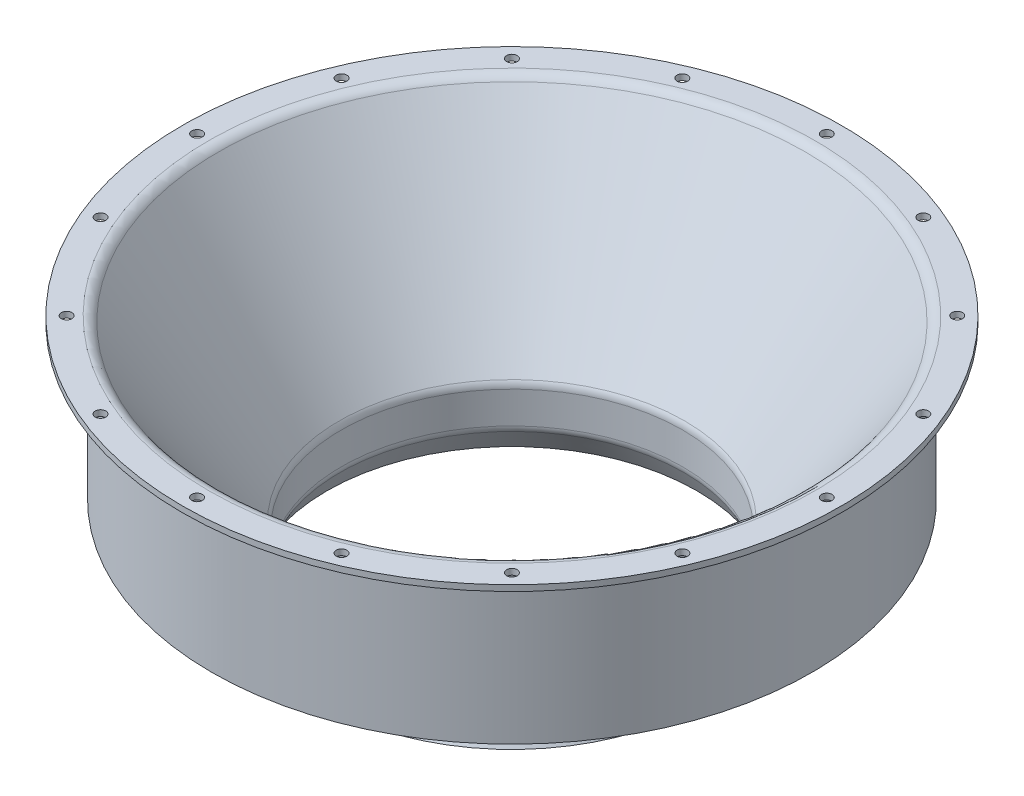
ISO-10303-21;
HEADER;
FILE_DESCRIPTION(('STEP AP214'),'2;1');
FILE_NAME('part.step','',(''),(''),'','','');
FILE_SCHEMA(('AUTOMOTIVE_DESIGN { 1 0 10303 214 1 1 1 1 }'));
ENDSEC;
DATA;
#1=APPLICATION_CONTEXT('core data for automotive mechanical design processes');
#2=APPLICATION_PROTOCOL_DEFINITION('international standard','automotive_design',2000,#1);
#3=PRODUCT_CONTEXT('',#1,'mechanical');
#4=PRODUCT('Part','Part','',(#3));
#5=PRODUCT_RELATED_PRODUCT_CATEGORY('part','',(#4));
#6=PRODUCT_DEFINITION_FORMATION('','',#4);
#7=PRODUCT_DEFINITION_CONTEXT('part definition',#1,'design');
#8=PRODUCT_DEFINITION('design','',#6,#7);
#9=PRODUCT_DEFINITION_SHAPE('','',#8);
#10=(LENGTH_UNIT() NAMED_UNIT(*) SI_UNIT(.MILLI.,.METRE.));
#11=(NAMED_UNIT(*) PLANE_ANGLE_UNIT() SI_UNIT($,.RADIAN.));
#12=(NAMED_UNIT(*) SI_UNIT($,.STERADIAN.) SOLID_ANGLE_UNIT());
#13=UNCERTAINTY_MEASURE_WITH_UNIT(LENGTH_MEASURE(1.E-05),#10,'distance_accuracy_value','');
#14=(GEOMETRIC_REPRESENTATION_CONTEXT(3) GLOBAL_UNCERTAINTY_ASSIGNED_CONTEXT((#13)) GLOBAL_UNIT_ASSIGNED_CONTEXT((#10,
#11,#12)) REPRESENTATION_CONTEXT('',''));
#15=CARTESIAN_POINT('',(0.,0.,0.));
#16=DIRECTION('',(0.,0.,1.));
#17=DIRECTION('',(1.,0.,0.));
#18=AXIS2_PLACEMENT_3D('',#15,#16,#17);
#19=CARTESIAN_POINT('',(0.,0.,0.));
#20=DIRECTION('',(0.,1.,0.));
#21=DIRECTION('',(0.,0.,1.));
#22=AXIS2_PLACEMENT_3D('',#19,#20,#21);
#23=CYLINDRICAL_SURFACE('',#22,280.);
#24=CARTESIAN_POINT('',(0.,0.,0.));
#25=DIRECTION('',(0.,1.,0.));
#26=DIRECTION('',(0.,0.,1.));
#27=AXIS2_PLACEMENT_3D('',#24,#25,#26);
#28=CIRCLE('',#27,280.);
#29=CARTESIAN_POINT('',(0.,0.,280.));
#30=VERTEX_POINT('',#29);
#31=EDGE_CURVE('E66',#30,#30,#28,.T.);
#32=ORIENTED_EDGE('',*,*,#31,.T.);
#33=EDGE_LOOP('',(#32));
#34=FACE_BOUND('',#33,.T.);
#35=CARTESIAN_POINT('',(0.,5.,0.));
#36=DIRECTION('',(0.,1.,0.));
#37=DIRECTION('',(0.,0.,1.));
#38=AXIS2_PLACEMENT_3D('',#35,#36,#37);
#39=CIRCLE('',#38,280.);
#40=CARTESIAN_POINT('',(0.,5.,280.));
#41=VERTEX_POINT('',#40);
#42=EDGE_CURVE('E81',#41,#41,#39,.T.);
#43=ORIENTED_EDGE('',*,*,#42,.F.);
#44=EDGE_LOOP('',(#43));
#45=FACE_BOUND('',#44,.T.);
#46=ADVANCED_FACE('F30',(#34,#45),#23,.T.);
#47=CARTESIAN_POINT('',(-280.,0.,0.));
#48=DIRECTION('',(0.,-1.,0.));
#49=DIRECTION('',(0.,0.,-1.));
#50=AXIS2_PLACEMENT_3D('',#47,#48,#49);
#51=PLANE('',#50);
#52=CARTESIAN_POINT('',(-102.367818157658,0.,247.137774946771));
#53=DIRECTION('',(0.,-1.,0.));
#54=DIRECTION('',(0.,0.,-1.));
#55=AXIS2_PLACEMENT_3D('',#52,#53,#54);
#56=CIRCLE('',#55,4.5);
#57=CARTESIAN_POINT('',(-102.367818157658,0.,242.637774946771));
#58=VERTEX_POINT('',#57);
#59=EDGE_CURVE('E183',#58,#58,#56,.T.);
#60=ORIENTED_EDGE('',*,*,#59,.F.);
#61=EDGE_LOOP('',(#60));
#62=FACE_BOUND('',#61,.T.);
#63=CARTESIAN_POINT('',(-189.151063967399,0.,189.151063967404));
#64=DIRECTION('',(0.,-1.,0.));
#65=DIRECTION('',(0.,0.,-1.));
#66=AXIS2_PLACEMENT_3D('',#63,#64,#65);
#67=CIRCLE('',#66,4.49999999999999);
#68=CARTESIAN_POINT('',(-189.151063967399,0.,184.651063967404));
#69=VERTEX_POINT('',#68);
#70=EDGE_CURVE('E177',#69,#69,#67,.T.);
#71=ORIENTED_EDGE('',*,*,#70,.F.);
#72=EDGE_LOOP('',(#71));
#73=FACE_BOUND('',#72,.T.);
#74=CARTESIAN_POINT('',(-247.137774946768,0.,102.367818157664));
#75=DIRECTION('',(0.,-1.,0.));
#76=DIRECTION('',(0.,0.,-1.));
#77=AXIS2_PLACEMENT_3D('',#74,#75,#76);
#78=CIRCLE('',#77,4.49999999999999);
#79=CARTESIAN_POINT('',(-247.137774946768,0.,97.8678181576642));
#80=VERTEX_POINT('',#79);
#81=EDGE_CURVE('E171',#80,#80,#78,.T.);
#82=ORIENTED_EDGE('',*,*,#81,.F.);
#83=EDGE_LOOP('',(#82));
#84=FACE_BOUND('',#83,.T.);
#85=CARTESIAN_POINT('',(-267.5,0.,2.80191539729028E-12));
#86=DIRECTION('',(0.,-1.,0.));
#87=DIRECTION('',(0.,0.,-1.));
#88=AXIS2_PLACEMENT_3D('',#85,#86,#87);
#89=CIRCLE('',#88,4.5);
#90=CARTESIAN_POINT('',(-267.5,0.,-4.4999999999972));
#91=VERTEX_POINT('',#90);
#92=EDGE_CURVE('E165',#91,#91,#89,.T.);
#93=ORIENTED_EDGE('',*,*,#92,.F.);
#94=EDGE_LOOP('',(#93));
#95=FACE_BOUND('',#94,.T.);
#96=CARTESIAN_POINT('',(-247.13777494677,0.,-102.367818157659));
#97=DIRECTION('',(0.,-1.,0.));
#98=DIRECTION('',(0.,0.,-1.));
#99=AXIS2_PLACEMENT_3D('',#96,#97,#98);
#100=CIRCLE('',#99,4.49999999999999);
#101=CARTESIAN_POINT('',(-247.13777494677,0.,-106.867818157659));
#102=VERTEX_POINT('',#101);
#103=EDGE_CURVE('E159',#102,#102,#100,.T.);
#104=ORIENTED_EDGE('',*,*,#103,.F.);
#105=EDGE_LOOP('',(#104));
#106=FACE_BOUND('',#105,.T.);
#107=CARTESIAN_POINT('',(-189.151063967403,0.,-189.1510639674));
#108=DIRECTION('',(0.,-1.,0.));
#109=DIRECTION('',(0.,0.,-1.));
#110=AXIS2_PLACEMENT_3D('',#107,#108,#109);
#111=CIRCLE('',#110,4.49999999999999);
#112=CARTESIAN_POINT('',(-189.151063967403,0.,-193.6510639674));
#113=VERTEX_POINT('',#112);
#114=EDGE_CURVE('E153',#113,#113,#111,.T.);
#115=ORIENTED_EDGE('',*,*,#114,.F.);
#116=EDGE_LOOP('',(#115));
#117=FACE_BOUND('',#116,.T.);
#118=CARTESIAN_POINT('',(-102.367818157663,0.,-247.137774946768));
#119=DIRECTION('',(0.,-1.,0.));
#120=DIRECTION('',(0.,0.,-1.));
#121=AXIS2_PLACEMENT_3D('',#118,#119,#120);
#122=CIRCLE('',#121,4.5);
#123=CARTESIAN_POINT('',(-102.367818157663,0.,-251.637774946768));
#124=VERTEX_POINT('',#123);
#125=EDGE_CURVE('E147',#124,#124,#122,.T.);
#126=ORIENTED_EDGE('',*,*,#125,.F.);
#127=EDGE_LOOP('',(#126));
#128=FACE_BOUND('',#127,.T.);
#129=CARTESIAN_POINT('',(-1.86794359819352E-12,0.,-267.5));
#130=DIRECTION('',(0.,-1.,0.));
#131=DIRECTION('',(0.,0.,-1.));
#132=AXIS2_PLACEMENT_3D('',#129,#130,#131);
#133=CIRCLE('',#132,4.5);
#134=CARTESIAN_POINT('',(-1.86794359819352E-12,0.,-272.));
#135=VERTEX_POINT('',#134);
#136=EDGE_CURVE('E141',#135,#135,#133,.T.);
#137=ORIENTED_EDGE('',*,*,#136,.F.);
#138=EDGE_LOOP('',(#137));
#139=FACE_BOUND('',#138,.T.);
#140=CARTESIAN_POINT('',(102.36781815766,0.,-247.13777494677));
#141=DIRECTION('',(0.,-1.,0.));
#142=DIRECTION('',(0.,0.,-1.));
#143=AXIS2_PLACEMENT_3D('',#140,#141,#142);
#144=CIRCLE('',#143,4.5);
#145=CARTESIAN_POINT('',(102.36781815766,0.,-251.63777494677));
#146=VERTEX_POINT('',#145);
#147=EDGE_CURVE('E135',#146,#146,#144,.T.);
#148=ORIENTED_EDGE('',*,*,#147,.F.);
#149=EDGE_LOOP('',(#148));
#150=FACE_BOUND('',#149,.T.);
#151=CARTESIAN_POINT('',(189.1510639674,0.,-189.151063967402));
#152=DIRECTION('',(0.,-1.,0.));
#153=DIRECTION('',(0.,0.,-1.));
#154=AXIS2_PLACEMENT_3D('',#151,#152,#153);
#155=CIRCLE('',#154,4.49999999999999);
#156=CARTESIAN_POINT('',(189.1510639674,0.,-193.651063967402));
#157=VERTEX_POINT('',#156);
#158=EDGE_CURVE('E129',#157,#157,#155,.T.);
#159=ORIENTED_EDGE('',*,*,#158,.F.);
#160=EDGE_LOOP('',(#159));
#161=FACE_BOUND('',#160,.T.);
#162=CARTESIAN_POINT('',(247.137774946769,0.,-102.367818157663));
#163=DIRECTION('',(0.,-1.,0.));
#164=DIRECTION('',(0.,0.,-1.));
#165=AXIS2_PLACEMENT_3D('',#162,#163,#164);
#166=CIRCLE('',#165,4.5);
#167=CARTESIAN_POINT('',(247.137774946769,0.,-106.867818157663));
#168=VERTEX_POINT('',#167);
#169=EDGE_CURVE('E123',#168,#168,#166,.T.);
#170=ORIENTED_EDGE('',*,*,#169,.F.);
#171=EDGE_LOOP('',(#170));
#172=FACE_BOUND('',#171,.T.);
#173=CARTESIAN_POINT('',(267.5,0.,-9.3397179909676E-13));
#174=DIRECTION('',(0.,-1.,0.));
#175=DIRECTION('',(0.,0.,-1.));
#176=AXIS2_PLACEMENT_3D('',#173,#174,#175);
#177=CIRCLE('',#176,4.5);
#178=CARTESIAN_POINT('',(267.5,0.,-4.50000000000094));
#179=VERTEX_POINT('',#178);
#180=EDGE_CURVE('E117',#179,#179,#177,.T.);
#181=ORIENTED_EDGE('',*,*,#180,.F.);
#182=EDGE_LOOP('',(#181));
#183=FACE_BOUND('',#182,.T.);
#184=CARTESIAN_POINT('',(247.137774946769,0.,102.367818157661));
#185=DIRECTION('',(0.,-1.,0.));
#186=DIRECTION('',(0.,0.,-1.));
#187=AXIS2_PLACEMENT_3D('',#184,#185,#186);
#188=CIRCLE('',#187,4.5);
#189=CARTESIAN_POINT('',(247.137774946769,0.,97.8678181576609));
#190=VERTEX_POINT('',#189);
#191=EDGE_CURVE('E111',#190,#190,#188,.T.);
#192=ORIENTED_EDGE('',*,*,#191,.F.);
#193=EDGE_LOOP('',(#192));
#194=FACE_BOUND('',#193,.T.);
#195=CARTESIAN_POINT('',(189.151063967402,0.,189.151063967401));
#196=DIRECTION('',(0.,-1.,0.));
#197=DIRECTION('',(0.,0.,-1.));
#198=AXIS2_PLACEMENT_3D('',#195,#196,#197);
#199=CIRCLE('',#198,4.49999999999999);
#200=CARTESIAN_POINT('',(189.151063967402,0.,184.651063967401));
#201=VERTEX_POINT('',#200);
#202=EDGE_CURVE('E105',#201,#201,#199,.T.);
#203=ORIENTED_EDGE('',*,*,#202,.F.);
#204=EDGE_LOOP('',(#203));
#205=FACE_BOUND('',#204,.T.);
#206=CARTESIAN_POINT('',(102.367818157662,0.,247.137774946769));
#207=DIRECTION('',(0.,-1.,0.));
#208=DIRECTION('',(0.,0.,-1.));
#209=AXIS2_PLACEMENT_3D('',#206,#207,#208);
#210=CIRCLE('',#209,4.5);
#211=CARTESIAN_POINT('',(102.367818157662,0.,242.637774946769));
#212=VERTEX_POINT('',#211);
#213=EDGE_CURVE('E99',#212,#212,#210,.T.);
#214=ORIENTED_EDGE('',*,*,#213,.F.);
#215=EDGE_LOOP('',(#214));
#216=FACE_BOUND('',#215,.T.);
#217=CARTESIAN_POINT('',(0.,0.,267.5));
#218=DIRECTION('',(0.,-1.,0.));
#219=DIRECTION('',(0.,0.,-1.));
#220=AXIS2_PLACEMENT_3D('',#217,#218,#219);
#221=CIRCLE('',#220,4.5);
#222=CARTESIAN_POINT('',(0.,0.,263.));
#223=VERTEX_POINT('',#222);
#224=EDGE_CURVE('E93',#223,#223,#221,.T.);
#225=ORIENTED_EDGE('',*,*,#224,.F.);
#226=EDGE_LOOP('',(#225));
#227=FACE_BOUND('',#226,.T.);
#228=CARTESIAN_POINT('',(0.,0.,0.));
#229=DIRECTION('',(0.,1.,0.));
#230=DIRECTION('',(0.,0.,1.));
#231=AXIS2_PLACEMENT_3D('',#228,#229,#230);
#232=CIRCLE('',#231,255.);
#233=CARTESIAN_POINT('',(0.,0.,255.));
#234=VERTEX_POINT('',#233);
#235=EDGE_CURVE('E90',#234,#234,#232,.T.);
#236=ORIENTED_EDGE('',*,*,#235,.T.);
#237=EDGE_LOOP('',(#236));
#238=FACE_BOUND('',#237,.T.);
#239=ORIENTED_EDGE('',*,*,#31,.F.);
#240=EDGE_LOOP('',(#239));
#241=FACE_BOUND('',#240,.T.);
#242=ADVANCED_FACE('F233',(#62,#73,#84,#95,#106,#117,#128,#139,#150,#161,#172,#183,#194,#205,
#216,#227,#238,#241),#51,.T.);
#243=CARTESIAN_POINT('',(0.,0.,0.));
#244=DIRECTION('',(0.,1.,0.));
#245=DIRECTION('',(0.,0.,1.));
#246=AXIS2_PLACEMENT_3D('',#243,#244,#245);
#247=CONICAL_SURFACE('',#246,255.,0.610725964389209);
#248=CARTESIAN_POINT('',(0.,-130.,0.));
#249=DIRECTION('',(0.,-1.,0.));
#250=DIRECTION('',(0.,0.,-1.));
#251=AXIS2_PLACEMENT_3D('',#248,#249,#250);
#252=CIRCLE('',#251,164.);
#253=CARTESIAN_POINT('',(0.,-130.,-164.));
#254=VERTEX_POINT('',#253);
#255=EDGE_CURVE('E42',#254,#254,#252,.F.);
#256=ORIENTED_EDGE('',*,*,#255,.F.);
#257=EDGE_LOOP('',(#256));
#258=FACE_BOUND('',#257,.T.);
#259=CARTESIAN_POINT('',(0.,-150.,0.));
#260=DIRECTION('',(0.,1.,0.));
#261=DIRECTION('',(0.,0.,1.));
#262=AXIS2_PLACEMENT_3D('',#259,#260,#261);
#263=CIRCLE('',#262,150.);
#264=CARTESIAN_POINT('',(0.,-150.,150.));
#265=VERTEX_POINT('',#264);
#266=EDGE_CURVE('E69',#265,#265,#263,.T.);
#267=ORIENTED_EDGE('',*,*,#266,.T.);
#268=EDGE_LOOP('',(#267));
#269=FACE_BOUND('',#268,.T.);
#270=ADVANCED_FACE('F240',(#258,#269),#247,.T.);
#271=CARTESIAN_POINT('',(0.,0.,0.));
#272=DIRECTION('',(0.,1.,0.));
#273=DIRECTION('',(0.,0.,1.));
#274=AXIS2_PLACEMENT_3D('',#271,#272,#273);
#275=CYLINDRICAL_SURFACE('',#274,150.);
#276=CARTESIAN_POINT('',(0.,-180.,0.));
#277=DIRECTION('',(0.,1.,0.));
#278=DIRECTION('',(0.,0.,1.));
#279=AXIS2_PLACEMENT_3D('',#276,#277,#278);
#280=CIRCLE('',#279,150.);
#281=CARTESIAN_POINT('',(0.,-180.,150.));
#282=VERTEX_POINT('',#281);
#283=EDGE_CURVE('E72',#282,#282,#280,.T.);
#284=ORIENTED_EDGE('',*,*,#283,.T.);
#285=EDGE_LOOP('',(#284));
#286=FACE_BOUND('',#285,.T.);
#287=ORIENTED_EDGE('',*,*,#266,.F.);
#288=EDGE_LOOP('',(#287));
#289=FACE_BOUND('',#288,.T.);
#290=ADVANCED_FACE('F275',(#286,#289),#275,.T.);
#291=CARTESIAN_POINT('',(0.,-180.,0.));
#292=DIRECTION('',(0.,-1.,0.));
#293=DIRECTION('',(0.,0.,-1.));
#294=AXIS2_PLACEMENT_3D('',#291,#292,#293);
#295=CONICAL_SURFACE('',#294,150.,0.5235987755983);
#296=CARTESIAN_POINT('',(0.,-200.,0.));
#297=DIRECTION('',(0.,1.,0.));
#298=DIRECTION('',(0.,0.,1.));
#299=AXIS2_PLACEMENT_3D('',#296,#297,#298);
#300=CIRCLE('',#299,161.547005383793);
#301=CARTESIAN_POINT('',(0.,-200.,161.547005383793));
#302=VERTEX_POINT('',#301);
#303=EDGE_CURVE('E75',#302,#302,#300,.T.);
#304=ORIENTED_EDGE('',*,*,#303,.T.);
#305=EDGE_LOOP('',(#304));
#306=FACE_BOUND('',#305,.T.);
#307=ORIENTED_EDGE('',*,*,#283,.F.);
#308=EDGE_LOOP('',(#307));
#309=FACE_BOUND('',#308,.T.);
#310=ADVANCED_FACE('F269',(#306,#309),#295,.T.);
#311=CARTESIAN_POINT('',(0.,-200.,0.));
#312=DIRECTION('',(0.,1.,0.));
#313=DIRECTION('',(0.,0.,1.));
#314=AXIS2_PLACEMENT_3D('',#311,#312,#313);
#315=CONICAL_SURFACE('',#314,161.547005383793,1.0471975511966);
#316=CARTESIAN_POINT('',(0.,-202.5,0.));
#317=DIRECTION('',(0.,1.,0.));
#318=DIRECTION('',(0.,0.,1.));
#319=AXIS2_PLACEMENT_3D('',#316,#317,#318);
#320=CIRCLE('',#319,157.21687836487);
#321=CARTESIAN_POINT('',(0.,-202.5,157.21687836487));
#322=VERTEX_POINT('',#321);
#323=EDGE_CURVE('E78',#322,#322,#320,.T.);
#324=ORIENTED_EDGE('',*,*,#323,.T.);
#325=EDGE_LOOP('',(#324));
#326=FACE_BOUND('',#325,.T.);
#327=ORIENTED_EDGE('',*,*,#303,.F.);
#328=EDGE_LOOP('',(#327));
#329=FACE_BOUND('',#328,.T.);
#330=ADVANCED_FACE('F263',(#326,#329),#315,.T.);
#331=CARTESIAN_POINT('',(0.,-202.5,0.));
#332=DIRECTION('',(0.,-1.,0.));
#333=DIRECTION('',(0.,0.,-1.));
#334=AXIS2_PLACEMENT_3D('',#331,#332,#333);
#335=CONICAL_SURFACE('',#334,157.21687836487,0.5235987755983);
#336=CARTESIAN_POINT('',(0.,-183.660254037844,0.));
#337=DIRECTION('',(0.,1.,0.));
#338=DIRECTION('',(0.,0.,1.));
#339=AXIS2_PLACEMENT_3D('',#336,#337,#338);
#340=CIRCLE('',#339,146.339745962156);
#341=CARTESIAN_POINT('',(0.,-183.660254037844,146.339745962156));
#342=VERTEX_POINT('',#341);
#343=EDGE_CURVE('E54',#342,#342,#340,.T.);
#344=ORIENTED_EDGE('',*,*,#343,.T.);
#345=EDGE_LOOP('',(#344));
#346=FACE_BOUND('',#345,.T.);
#347=ORIENTED_EDGE('',*,*,#323,.F.);
#348=EDGE_LOOP('',(#347));
#349=FACE_BOUND('',#348,.T.);
#350=ADVANCED_FACE('F259',(#346,#349),#335,.F.);
#351=CARTESIAN_POINT('',(0.,0.,0.));
#352=DIRECTION('',(0.,1.,0.));
#353=DIRECTION('',(0.,0.,1.));
#354=AXIS2_PLACEMENT_3D('',#351,#352,#353);
#355=CYLINDRICAL_SURFACE('',#354,145.);
#356=CARTESIAN_POINT('',(0.,-178.660254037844,0.));
#357=DIRECTION('',(0.,-1.,0.));
#358=DIRECTION('',(0.,0.,-1.));
#359=AXIS2_PLACEMENT_3D('',#356,#357,#358);
#360=CIRCLE('',#359,145.);
#361=CARTESIAN_POINT('',(0.,-178.660254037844,-145.));
#362=VERTEX_POINT('',#361);
#363=EDGE_CURVE('E46',#362,#362,#360,.T.);
#364=ORIENTED_EDGE('',*,*,#363,.T.);
#365=EDGE_LOOP('',(#364));
#366=FACE_BOUND('',#365,.T.);
#367=CARTESIAN_POINT('',(0.,-151.576111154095,0.));
#368=DIRECTION('',(0.,-1.,0.));
#369=DIRECTION('',(0.,0.,-1.));
#370=AXIS2_PLACEMENT_3D('',#367,#368,#369);
#371=CIRCLE('',#370,145.);
#372=CARTESIAN_POINT('',(0.,-151.576111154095,-145.));
#373=VERTEX_POINT('',#372);
#374=EDGE_CURVE('E51',#373,#373,#371,.F.);
#375=ORIENTED_EDGE('',*,*,#374,.T.);
#376=EDGE_LOOP('',(#375));
#377=FACE_BOUND('',#376,.T.);
#378=ADVANCED_FACE('F262',(#366,#377),#355,.F.);
#379=CARTESIAN_POINT('',(0.,-148.423888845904,0.));
#380=DIRECTION('',(0.,1.,0.));
#381=DIRECTION('',(0.,0.,1.));
#382=AXIS2_PLACEMENT_3D('',#379,#380,#381);
#383=CONICAL_SURFACE('',#382,145.,0.610725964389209);
#384=CARTESIAN_POINT('',(0.,0.734623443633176,0.));
#385=DIRECTION('',(0.,-1.,0.));
#386=DIRECTION('',(0.,0.,-1.));
#387=AXIS2_PLACEMENT_3D('',#384,#385,#386);
#388=CIRCLE('',#387,249.410958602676);
#389=CARTESIAN_POINT('',(0.,0.734623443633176,-249.410958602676));
#390=VERTEX_POINT('',#389);
#391=EDGE_CURVE('E60',#390,#390,#388,.F.);
#392=ORIENTED_EDGE('',*,*,#391,.T.);
#393=EDGE_LOOP('',(#392));
#394=FACE_BOUND('',#393,.T.);
#395=CARTESIAN_POINT('',(0.,-145.841487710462,0.));
#396=DIRECTION('',(0.,-1.,0.));
#397=DIRECTION('',(0.,0.,-1.));
#398=AXIS2_PLACEMENT_3D('',#395,#396,#397);
#399=CIRCLE('',#398,146.80768079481);
#400=CARTESIAN_POINT('',(0.,-145.841487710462,-146.80768079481));
#401=VERTEX_POINT('',#400);
#402=EDGE_CURVE('E63',#401,#401,#399,.T.);
#403=ORIENTED_EDGE('',*,*,#402,.T.);
#404=EDGE_LOOP('',(#403));
#405=FACE_BOUND('',#404,.T.);
#406=ADVANCED_FACE('F196',(#394,#405),#383,.F.);
#407=CARTESIAN_POINT('',(-280.,5.,0.));
#408=DIRECTION('',(0.,1.,0.));
#409=DIRECTION('',(0.,0.,1.));
#410=AXIS2_PLACEMENT_3D('',#407,#408,#409);
#411=PLANE('',#410);
#412=CARTESIAN_POINT('',(-102.367818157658,5.,247.137774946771));
#413=DIRECTION('',(0.,1.,0.));
#414=DIRECTION('',(0.,0.,1.));
#415=AXIS2_PLACEMENT_3D('',#412,#413,#414);
#416=CIRCLE('',#415,4.50000000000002);
#417=CARTESIAN_POINT('',(-102.367818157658,5.,251.637774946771));
#418=VERTEX_POINT('',#417);
#419=EDGE_CURVE('E186',#418,#418,#416,.T.);
#420=ORIENTED_EDGE('',*,*,#419,.F.);
#421=EDGE_LOOP('',(#420));
#422=FACE_BOUND('',#421,.T.);
#423=CARTESIAN_POINT('',(-189.151063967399,5.,189.151063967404));
#424=DIRECTION('',(0.,1.,0.));
#425=DIRECTION('',(0.,0.,1.));
#426=AXIS2_PLACEMENT_3D('',#423,#424,#425);
#427=CIRCLE('',#426,4.5);
#428=CARTESIAN_POINT('',(-189.151063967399,5.,193.651063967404));
#429=VERTEX_POINT('',#428);
#430=EDGE_CURVE('E180',#429,#429,#427,.T.);
#431=ORIENTED_EDGE('',*,*,#430,.F.);
#432=EDGE_LOOP('',(#431));
#433=FACE_BOUND('',#432,.T.);
#434=CARTESIAN_POINT('',(-247.137774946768,5.,102.367818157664));
#435=DIRECTION('',(0.,1.,0.));
#436=DIRECTION('',(0.,0.,1.));
#437=AXIS2_PLACEMENT_3D('',#434,#435,#436);
#438=CIRCLE('',#437,4.5);
#439=CARTESIAN_POINT('',(-247.137774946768,5.,106.867818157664));
#440=VERTEX_POINT('',#439);
#441=EDGE_CURVE('E174',#440,#440,#438,.T.);
#442=ORIENTED_EDGE('',*,*,#441,.F.);
#443=EDGE_LOOP('',(#442));
#444=FACE_BOUND('',#443,.T.);
#445=CARTESIAN_POINT('',(-267.5,5.,2.80191539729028E-12));
#446=DIRECTION('',(0.,1.,0.));
#447=DIRECTION('',(0.,0.,1.));
#448=AXIS2_PLACEMENT_3D('',#445,#446,#447);
#449=CIRCLE('',#448,4.5);
#450=CARTESIAN_POINT('',(-267.5,5.,4.50000000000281));
#451=VERTEX_POINT('',#450);
#452=EDGE_CURVE('E168',#451,#451,#449,.T.);
#453=ORIENTED_EDGE('',*,*,#452,.F.);
#454=EDGE_LOOP('',(#453));
#455=FACE_BOUND('',#454,.T.);
#456=CARTESIAN_POINT('',(-247.13777494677,5.,-102.367818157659));
#457=DIRECTION('',(0.,1.,0.));
#458=DIRECTION('',(0.,0.,1.));
#459=AXIS2_PLACEMENT_3D('',#456,#457,#458);
#460=CIRCLE('',#459,4.5);
#461=CARTESIAN_POINT('',(-247.13777494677,5.,-97.867818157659));
#462=VERTEX_POINT('',#461);
#463=EDGE_CURVE('E162',#462,#462,#460,.T.);
#464=ORIENTED_EDGE('',*,*,#463,.F.);
#465=EDGE_LOOP('',(#464));
#466=FACE_BOUND('',#465,.T.);
#467=CARTESIAN_POINT('',(-189.151063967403,5.,-189.1510639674));
#468=DIRECTION('',(0.,1.,0.));
#469=DIRECTION('',(0.,0.,1.));
#470=AXIS2_PLACEMENT_3D('',#467,#468,#469);
#471=CIRCLE('',#470,4.5);
#472=CARTESIAN_POINT('',(-189.151063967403,5.,-184.6510639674));
#473=VERTEX_POINT('',#472);
#474=EDGE_CURVE('E156',#473,#473,#471,.T.);
#475=ORIENTED_EDGE('',*,*,#474,.F.);
#476=EDGE_LOOP('',(#475));
#477=FACE_BOUND('',#476,.T.);
#478=CARTESIAN_POINT('',(-102.367818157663,5.,-247.137774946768));
#479=DIRECTION('',(0.,1.,0.));
#480=DIRECTION('',(0.,0.,1.));
#481=AXIS2_PLACEMENT_3D('',#478,#479,#480);
#482=CIRCLE('',#481,4.50000000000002);
#483=CARTESIAN_POINT('',(-102.367818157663,5.,-242.637774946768));
#484=VERTEX_POINT('',#483);
#485=EDGE_CURVE('E150',#484,#484,#482,.T.);
#486=ORIENTED_EDGE('',*,*,#485,.F.);
#487=EDGE_LOOP('',(#486));
#488=FACE_BOUND('',#487,.T.);
#489=CARTESIAN_POINT('',(-1.86794359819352E-12,5.,-267.5));
#490=DIRECTION('',(0.,1.,0.));
#491=DIRECTION('',(0.,0.,1.));
#492=AXIS2_PLACEMENT_3D('',#489,#490,#491);
#493=CIRCLE('',#492,4.50000000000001);
#494=CARTESIAN_POINT('',(-1.86794359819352E-12,5.,-263.));
#495=VERTEX_POINT('',#494);
#496=EDGE_CURVE('E144',#495,#495,#493,.T.);
#497=ORIENTED_EDGE('',*,*,#496,.F.);
#498=EDGE_LOOP('',(#497));
#499=FACE_BOUND('',#498,.T.);
#500=CARTESIAN_POINT('',(102.36781815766,5.,-247.13777494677));
#501=DIRECTION('',(0.,1.,0.));
#502=DIRECTION('',(0.,0.,1.));
#503=AXIS2_PLACEMENT_3D('',#500,#501,#502);
#504=CIRCLE('',#503,4.50000000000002);
#505=CARTESIAN_POINT('',(102.36781815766,5.,-242.63777494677));
#506=VERTEX_POINT('',#505);
#507=EDGE_CURVE('E138',#506,#506,#504,.T.);
#508=ORIENTED_EDGE('',*,*,#507,.F.);
#509=EDGE_LOOP('',(#508));
#510=FACE_BOUND('',#509,.T.);
#511=CARTESIAN_POINT('',(189.1510639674,5.,-189.151063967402));
#512=DIRECTION('',(0.,1.,0.));
#513=DIRECTION('',(0.,0.,1.));
#514=AXIS2_PLACEMENT_3D('',#511,#512,#513);
#515=CIRCLE('',#514,4.5);
#516=CARTESIAN_POINT('',(189.1510639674,5.,-184.651063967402));
#517=VERTEX_POINT('',#516);
#518=EDGE_CURVE('E132',#517,#517,#515,.T.);
#519=ORIENTED_EDGE('',*,*,#518,.F.);
#520=EDGE_LOOP('',(#519));
#521=FACE_BOUND('',#520,.T.);
#522=CARTESIAN_POINT('',(247.137774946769,5.,-102.367818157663));
#523=DIRECTION('',(0.,1.,0.));
#524=DIRECTION('',(0.,0.,1.));
#525=AXIS2_PLACEMENT_3D('',#522,#523,#524);
#526=CIRCLE('',#525,4.50000000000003);
#527=CARTESIAN_POINT('',(247.137774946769,5.,-97.8678181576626));
#528=VERTEX_POINT('',#527);
#529=EDGE_CURVE('E126',#528,#528,#526,.T.);
#530=ORIENTED_EDGE('',*,*,#529,.F.);
#531=EDGE_LOOP('',(#530));
#532=FACE_BOUND('',#531,.T.);
#533=CARTESIAN_POINT('',(267.5,5.,-9.3397179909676E-13));
#534=DIRECTION('',(0.,1.,0.));
#535=DIRECTION('',(0.,0.,1.));
#536=AXIS2_PLACEMENT_3D('',#533,#534,#535);
#537=CIRCLE('',#536,4.5);
#538=CARTESIAN_POINT('',(267.5,5.,4.49999999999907));
#539=VERTEX_POINT('',#538);
#540=EDGE_CURVE('E120',#539,#539,#537,.T.);
#541=ORIENTED_EDGE('',*,*,#540,.F.);
#542=EDGE_LOOP('',(#541));
#543=FACE_BOUND('',#542,.T.);
#544=CARTESIAN_POINT('',(247.137774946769,5.,102.367818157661));
#545=DIRECTION('',(0.,1.,0.));
#546=DIRECTION('',(0.,0.,1.));
#547=AXIS2_PLACEMENT_3D('',#544,#545,#546);
#548=CIRCLE('',#547,4.5);
#549=CARTESIAN_POINT('',(247.137774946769,5.,106.867818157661));
#550=VERTEX_POINT('',#549);
#551=EDGE_CURVE('E114',#550,#550,#548,.T.);
#552=ORIENTED_EDGE('',*,*,#551,.F.);
#553=EDGE_LOOP('',(#552));
#554=FACE_BOUND('',#553,.T.);
#555=CARTESIAN_POINT('',(189.151063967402,5.,189.151063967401));
#556=DIRECTION('',(0.,1.,0.));
#557=DIRECTION('',(0.,0.,1.));
#558=AXIS2_PLACEMENT_3D('',#555,#556,#557);
#559=CIRCLE('',#558,4.5);
#560=CARTESIAN_POINT('',(189.151063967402,5.,193.651063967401));
#561=VERTEX_POINT('',#560);
#562=EDGE_CURVE('E108',#561,#561,#559,.T.);
#563=ORIENTED_EDGE('',*,*,#562,.F.);
#564=EDGE_LOOP('',(#563));
#565=FACE_BOUND('',#564,.T.);
#566=CARTESIAN_POINT('',(102.367818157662,5.,247.137774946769));
#567=DIRECTION('',(0.,1.,0.));
#568=DIRECTION('',(0.,0.,1.));
#569=AXIS2_PLACEMENT_3D('',#566,#567,#568);
#570=CIRCLE('',#569,4.50000000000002);
#571=CARTESIAN_POINT('',(102.367818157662,5.,251.637774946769));
#572=VERTEX_POINT('',#571);
#573=EDGE_CURVE('E102',#572,#572,#570,.T.);
#574=ORIENTED_EDGE('',*,*,#573,.F.);
#575=EDGE_LOOP('',(#574));
#576=FACE_BOUND('',#575,.T.);
#577=CARTESIAN_POINT('',(0.,5.,267.5));
#578=DIRECTION('',(0.,1.,0.));
#579=DIRECTION('',(0.,0.,1.));
#580=AXIS2_PLACEMENT_3D('',#577,#578,#579);
#581=CIRCLE('',#580,4.50000000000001);
#582=CARTESIAN_POINT('',(0.,5.,272.));
#583=VERTEX_POINT('',#582);
#584=EDGE_CURVE('E96',#583,#583,#581,.T.);
#585=ORIENTED_EDGE('',*,*,#584,.F.);
#586=EDGE_LOOP('',(#585));
#587=FACE_BOUND('',#586,.T.);
#588=CARTESIAN_POINT('',(0.,5.,0.));
#589=DIRECTION('',(0.,1.,0.));
#590=DIRECTION('',(0.,0.,1.));
#591=AXIS2_PLACEMENT_3D('',#588,#589,#590);
#592=CIRCLE('',#591,257.603277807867);
#593=CARTESIAN_POINT('',(0.,5.,257.603277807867));
#594=VERTEX_POINT('',#593);
#595=EDGE_CURVE('E57',#594,#594,#592,.F.);
#596=ORIENTED_EDGE('',*,*,#595,.T.);
#597=EDGE_LOOP('',(#596));
#598=FACE_BOUND('',#597,.T.);
#599=ORIENTED_EDGE('',*,*,#42,.T.);
#600=EDGE_LOOP('',(#599));
#601=FACE_BOUND('',#600,.T.);
#602=ADVANCED_FACE('F192',(#422,#433,#444,#455,#466,#477,#488,#499,#510,#521,#532,#543,#554,
#565,#576,#587,#598,#601),#411,.T.);
#603=CARTESIAN_POINT('',(0.,-5.,0.));
#604=DIRECTION('',(0.,1.,0.));
#605=DIRECTION('',(0.,0.,1.));
#606=AXIS2_PLACEMENT_3D('',#603,#604,#605);
#607=TOROIDAL_SURFACE('',#606,257.603277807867,10.);
#608=ORIENTED_EDGE('',*,*,#595,.F.);
#609=EDGE_LOOP('',(#608));
#610=FACE_BOUND('',#609,.T.);
#611=ORIENTED_EDGE('',*,*,#391,.F.);
#612=EDGE_LOOP('',(#611));
#613=FACE_BOUND('',#612,.T.);
#614=ADVANCED_FACE('F195',(#610,#613),#607,.T.);
#615=CARTESIAN_POINT('',(0.,-178.660254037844,0.));
#616=DIRECTION('',(0.,-1.,0.));
#617=DIRECTION('',(0.,0.,-1.));
#618=AXIS2_PLACEMENT_3D('',#615,#616,#617);
#619=TOROIDAL_SURFACE('',#618,155.,10.);
#620=ORIENTED_EDGE('',*,*,#363,.F.);
#621=EDGE_LOOP('',(#620));
#622=FACE_BOUND('',#621,.T.);
#623=ORIENTED_EDGE('',*,*,#343,.F.);
#624=EDGE_LOOP('',(#623));
#625=FACE_BOUND('',#624,.T.);
#626=ADVANCED_FACE('F246',(#622,#625),#619,.T.);
#627=CARTESIAN_POINT('',(0.,-151.576111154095,0.));
#628=DIRECTION('',(0.,-1.,0.));
#629=DIRECTION('',(0.,0.,-1.));
#630=AXIS2_PLACEMENT_3D('',#627,#628,#629);
#631=TOROIDAL_SURFACE('',#630,155.,10.);
#632=ORIENTED_EDGE('',*,*,#402,.F.);
#633=EDGE_LOOP('',(#632));
#634=FACE_BOUND('',#633,.T.);
#635=ORIENTED_EDGE('',*,*,#374,.F.);
#636=EDGE_LOOP('',(#635));
#637=FACE_BOUND('',#636,.T.);
#638=ADVANCED_FACE('F32',(#634,#637),#631,.T.);
#639=CARTESIAN_POINT('',(0.,73.7144385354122,0.));
#640=DIRECTION('',(0.,1.,0.));
#641=DIRECTION('',(0.,0.,1.));
#642=AXIS2_PLACEMENT_3D('',#639,#640,#641);
#643=CYLINDRICAL_SURFACE('',#642,255.);
#644=CARTESIAN_POINT('',(0.,-130.,0.));
#645=DIRECTION('',(0.,1.,0.));
#646=DIRECTION('',(0.,0.,1.));
#647=AXIS2_PLACEMENT_3D('',#644,#645,#646);
#648=CIRCLE('',#647,255.);
#649=CARTESIAN_POINT('',(0.,-130.,255.));
#650=VERTEX_POINT('',#649);
#651=EDGE_CURVE('E87',#650,#650,#648,.T.);
#652=ORIENTED_EDGE('',*,*,#651,.T.);
#653=EDGE_LOOP('',(#652));
#654=FACE_BOUND('',#653,.T.);
#655=ORIENTED_EDGE('',*,*,#235,.F.);
#656=EDGE_LOOP('',(#655));
#657=FACE_BOUND('',#656,.T.);
#658=ADVANCED_FACE('F253',(#654,#657),#643,.T.);
#659=CARTESIAN_POINT('',(-255.,-130.,0.));
#660=DIRECTION('',(0.,-1.,0.));
#661=DIRECTION('',(0.,0.,-1.));
#662=AXIS2_PLACEMENT_3D('',#659,#660,#661);
#663=PLANE('',#662);
#664=ORIENTED_EDGE('',*,*,#255,.T.);
#665=EDGE_LOOP('',(#664));
#666=FACE_BOUND('',#665,.T.);
#667=ORIENTED_EDGE('',*,*,#651,.F.);
#668=EDGE_LOOP('',(#667));
#669=FACE_BOUND('',#668,.T.);
#670=ADVANCED_FACE('F363',(#666,#669),#663,.T.);
#671=CARTESIAN_POINT('',(0.,5.,267.5));
#672=DIRECTION('',(0.,1.,0.));
#673=DIRECTION('',(0.,0.,1.));
#674=AXIS2_PLACEMENT_3D('',#671,#672,#673);
#675=CYLINDRICAL_SURFACE('',#674,4.5);
#676=ORIENTED_EDGE('',*,*,#224,.T.);
#677=EDGE_LOOP('',(#676));
#678=FACE_BOUND('',#677,.T.);
#679=ORIENTED_EDGE('',*,*,#584,.T.);
#680=EDGE_LOOP('',(#679));
#681=FACE_BOUND('',#680,.T.);
#682=ADVANCED_FACE('F371',(#678,#681),#675,.F.);
#683=CARTESIAN_POINT('',(102.367818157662,5.,247.137774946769));
#684=DIRECTION('',(0.,1.,0.));
#685=DIRECTION('',(0.,0.,1.));
#686=AXIS2_PLACEMENT_3D('',#683,#684,#685);
#687=CYLINDRICAL_SURFACE('',#686,4.5);
#688=ORIENTED_EDGE('',*,*,#213,.T.);
#689=EDGE_LOOP('',(#688));
#690=FACE_BOUND('',#689,.T.);
#691=ORIENTED_EDGE('',*,*,#573,.T.);
#692=EDGE_LOOP('',(#691));
#693=FACE_BOUND('',#692,.T.);
#694=ADVANCED_FACE('F392',(#690,#693),#687,.F.);
#695=CARTESIAN_POINT('',(189.151063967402,5.,189.151063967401));
#696=DIRECTION('',(0.,1.,0.));
#697=DIRECTION('',(0.,0.,1.));
#698=AXIS2_PLACEMENT_3D('',#695,#696,#697);
#699=CYLINDRICAL_SURFACE('',#698,4.49999999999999);
#700=ORIENTED_EDGE('',*,*,#202,.T.);
#701=EDGE_LOOP('',(#700));
#702=FACE_BOUND('',#701,.T.);
#703=ORIENTED_EDGE('',*,*,#562,.T.);
#704=EDGE_LOOP('',(#703));
#705=FACE_BOUND('',#704,.T.);
#706=ADVANCED_FACE('F435',(#702,#705),#699,.F.);
#707=CARTESIAN_POINT('',(247.137774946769,5.,102.367818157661));
#708=DIRECTION('',(0.,1.,0.));
#709=DIRECTION('',(0.,0.,1.));
#710=AXIS2_PLACEMENT_3D('',#707,#708,#709);
#711=CYLINDRICAL_SURFACE('',#710,4.5);
#712=ORIENTED_EDGE('',*,*,#191,.T.);
#713=EDGE_LOOP('',(#712));
#714=FACE_BOUND('',#713,.T.);
#715=ORIENTED_EDGE('',*,*,#551,.T.);
#716=EDGE_LOOP('',(#715));
#717=FACE_BOUND('',#716,.T.);
#718=ADVANCED_FACE('F442',(#714,#717),#711,.F.);
#719=CARTESIAN_POINT('',(267.5,5.,-9.3397179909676E-13));
#720=DIRECTION('',(0.,1.,0.));
#721=DIRECTION('',(0.,0.,1.));
#722=AXIS2_PLACEMENT_3D('',#719,#720,#721);
#723=CYLINDRICAL_SURFACE('',#722,4.5);
#724=ORIENTED_EDGE('',*,*,#180,.T.);
#725=EDGE_LOOP('',(#724));
#726=FACE_BOUND('',#725,.T.);
#727=ORIENTED_EDGE('',*,*,#540,.T.);
#728=EDGE_LOOP('',(#727));
#729=FACE_BOUND('',#728,.T.);
#730=ADVANCED_FACE('F450',(#726,#729),#723,.F.);
#731=CARTESIAN_POINT('',(247.137774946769,5.,-102.367818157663));
#732=DIRECTION('',(0.,1.,0.));
#733=DIRECTION('',(0.,0.,1.));
#734=AXIS2_PLACEMENT_3D('',#731,#732,#733);
#735=CYLINDRICAL_SURFACE('',#734,4.5);
#736=ORIENTED_EDGE('',*,*,#169,.T.);
#737=EDGE_LOOP('',(#736));
#738=FACE_BOUND('',#737,.T.);
#739=ORIENTED_EDGE('',*,*,#529,.T.);
#740=EDGE_LOOP('',(#739));
#741=FACE_BOUND('',#740,.T.);
#742=ADVANCED_FACE('F458',(#738,#741),#735,.F.);
#743=CARTESIAN_POINT('',(189.1510639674,5.,-189.151063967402));
#744=DIRECTION('',(0.,1.,0.));
#745=DIRECTION('',(0.,0.,1.));
#746=AXIS2_PLACEMENT_3D('',#743,#744,#745);
#747=CYLINDRICAL_SURFACE('',#746,4.49999999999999);
#748=ORIENTED_EDGE('',*,*,#158,.T.);
#749=EDGE_LOOP('',(#748));
#750=FACE_BOUND('',#749,.T.);
#751=ORIENTED_EDGE('',*,*,#518,.T.);
#752=EDGE_LOOP('',(#751));
#753=FACE_BOUND('',#752,.T.);
#754=ADVANCED_FACE('F466',(#750,#753),#747,.F.);
#755=CARTESIAN_POINT('',(102.36781815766,5.,-247.13777494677));
#756=DIRECTION('',(0.,1.,0.));
#757=DIRECTION('',(0.,0.,1.));
#758=AXIS2_PLACEMENT_3D('',#755,#756,#757);
#759=CYLINDRICAL_SURFACE('',#758,4.5);
#760=ORIENTED_EDGE('',*,*,#147,.T.);
#761=EDGE_LOOP('',(#760));
#762=FACE_BOUND('',#761,.T.);
#763=ORIENTED_EDGE('',*,*,#507,.T.);
#764=EDGE_LOOP('',(#763));
#765=FACE_BOUND('',#764,.T.);
#766=ADVANCED_FACE('F474',(#762,#765),#759,.F.);
#767=CARTESIAN_POINT('',(-1.86794359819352E-12,5.,-267.5));
#768=DIRECTION('',(0.,1.,0.));
#769=DIRECTION('',(0.,0.,1.));
#770=AXIS2_PLACEMENT_3D('',#767,#768,#769);
#771=CYLINDRICAL_SURFACE('',#770,4.5);
#772=ORIENTED_EDGE('',*,*,#136,.T.);
#773=EDGE_LOOP('',(#772));
#774=FACE_BOUND('',#773,.T.);
#775=ORIENTED_EDGE('',*,*,#496,.T.);
#776=EDGE_LOOP('',(#775));
#777=FACE_BOUND('',#776,.T.);
#778=ADVANCED_FACE('F482',(#774,#777),#771,.F.);
#779=CARTESIAN_POINT('',(-102.367818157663,5.,-247.137774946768));
#780=DIRECTION('',(0.,1.,0.));
#781=DIRECTION('',(0.,0.,1.));
#782=AXIS2_PLACEMENT_3D('',#779,#780,#781);
#783=CYLINDRICAL_SURFACE('',#782,4.5);
#784=ORIENTED_EDGE('',*,*,#125,.T.);
#785=EDGE_LOOP('',(#784));
#786=FACE_BOUND('',#785,.T.);
#787=ORIENTED_EDGE('',*,*,#485,.T.);
#788=EDGE_LOOP('',(#787));
#789=FACE_BOUND('',#788,.T.);
#790=ADVANCED_FACE('F490',(#786,#789),#783,.F.);
#791=CARTESIAN_POINT('',(-189.151063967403,5.,-189.1510639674));
#792=DIRECTION('',(0.,1.,0.));
#793=DIRECTION('',(0.,0.,1.));
#794=AXIS2_PLACEMENT_3D('',#791,#792,#793);
#795=CYLINDRICAL_SURFACE('',#794,4.49999999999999);
#796=ORIENTED_EDGE('',*,*,#114,.T.);
#797=EDGE_LOOP('',(#796));
#798=FACE_BOUND('',#797,.T.);
#799=ORIENTED_EDGE('',*,*,#474,.T.);
#800=EDGE_LOOP('',(#799));
#801=FACE_BOUND('',#800,.T.);
#802=ADVANCED_FACE('F498',(#798,#801),#795,.F.);
#803=CARTESIAN_POINT('',(-247.13777494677,5.,-102.367818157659));
#804=DIRECTION('',(0.,1.,0.));
#805=DIRECTION('',(0.,0.,1.));
#806=AXIS2_PLACEMENT_3D('',#803,#804,#805);
#807=CYLINDRICAL_SURFACE('',#806,4.49999999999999);
#808=ORIENTED_EDGE('',*,*,#103,.T.);
#809=EDGE_LOOP('',(#808));
#810=FACE_BOUND('',#809,.T.);
#811=ORIENTED_EDGE('',*,*,#463,.T.);
#812=EDGE_LOOP('',(#811));
#813=FACE_BOUND('',#812,.T.);
#814=ADVANCED_FACE('F506',(#810,#813),#807,.F.);
#815=CARTESIAN_POINT('',(-267.5,5.,2.80191539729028E-12));
#816=DIRECTION('',(0.,1.,0.));
#817=DIRECTION('',(0.,0.,1.));
#818=AXIS2_PLACEMENT_3D('',#815,#816,#817);
#819=CYLINDRICAL_SURFACE('',#818,4.5);
#820=ORIENTED_EDGE('',*,*,#92,.T.);
#821=EDGE_LOOP('',(#820));
#822=FACE_BOUND('',#821,.T.);
#823=ORIENTED_EDGE('',*,*,#452,.T.);
#824=EDGE_LOOP('',(#823));
#825=FACE_BOUND('',#824,.T.);
#826=ADVANCED_FACE('F514',(#822,#825),#819,.F.);
#827=CARTESIAN_POINT('',(-247.137774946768,5.,102.367818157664));
#828=DIRECTION('',(0.,1.,0.));
#829=DIRECTION('',(0.,0.,1.));
#830=AXIS2_PLACEMENT_3D('',#827,#828,#829);
#831=CYLINDRICAL_SURFACE('',#830,4.49999999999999);
#832=ORIENTED_EDGE('',*,*,#81,.T.);
#833=EDGE_LOOP('',(#832));
#834=FACE_BOUND('',#833,.T.);
#835=ORIENTED_EDGE('',*,*,#441,.T.);
#836=EDGE_LOOP('',(#835));
#837=FACE_BOUND('',#836,.T.);
#838=ADVANCED_FACE('F522',(#834,#837),#831,.F.);
#839=CARTESIAN_POINT('',(-189.151063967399,5.,189.151063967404));
#840=DIRECTION('',(0.,1.,0.));
#841=DIRECTION('',(0.,0.,1.));
#842=AXIS2_PLACEMENT_3D('',#839,#840,#841);
#843=CYLINDRICAL_SURFACE('',#842,4.49999999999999);
#844=ORIENTED_EDGE('',*,*,#70,.T.);
#845=EDGE_LOOP('',(#844));
#846=FACE_BOUND('',#845,.T.);
#847=ORIENTED_EDGE('',*,*,#430,.T.);
#848=EDGE_LOOP('',(#847));
#849=FACE_BOUND('',#848,.T.);
#850=ADVANCED_FACE('F530',(#846,#849),#843,.F.);
#851=CARTESIAN_POINT('',(-102.367818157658,5.,247.137774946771));
#852=DIRECTION('',(0.,1.,0.));
#853=DIRECTION('',(0.,0.,1.));
#854=AXIS2_PLACEMENT_3D('',#851,#852,#853);
#855=CYLINDRICAL_SURFACE('',#854,4.5);
#856=ORIENTED_EDGE('',*,*,#59,.T.);
#857=EDGE_LOOP('',(#856));
#858=FACE_BOUND('',#857,.T.);
#859=ORIENTED_EDGE('',*,*,#419,.T.);
#860=EDGE_LOOP('',(#859));
#861=FACE_BOUND('',#860,.T.);
#862=ADVANCED_FACE('F190',(#858,#861),#855,.F.);
#863=CLOSED_SHELL('',(#46,#242,#270,#290,#310,#330,#350,#378,#406,#602,#614,#626,#638,#658,#670,
#682,#694,#706,#718,#730,#742,#754,#766,#778,#790,#802,#814,#826,#838,#850,#862));
#864=CARTESIAN_POINT('',(0.,73.7144385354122,0.));
#865=DIRECTION('',(0.,1.,0.));
#866=DIRECTION('',(0.,0.,1.));
#867=AXIS2_PLACEMENT_3D('',#864,#865,#866);
#868=CYLINDRICAL_SURFACE('',#867,250.);
#869=CARTESIAN_POINT('',(0.,-7.14285714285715,0.));
#870=DIRECTION('',(0.,1.,0.));
#871=DIRECTION('',(0.,0.,1.));
#872=AXIS2_PLACEMENT_3D('',#869,#870,#871);
#873=CIRCLE('',#872,250.);
#874=CARTESIAN_POINT('',(0.,-7.14285714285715,250.));
#875=VERTEX_POINT('',#874);
#876=EDGE_CURVE('E10',#875,#875,#873,.T.);
#877=ORIENTED_EDGE('',*,*,#876,.T.);
#878=EDGE_LOOP('',(#877));
#879=FACE_BOUND('',#878,.T.);
#880=CARTESIAN_POINT('',(0.,-125.,0.));
#881=DIRECTION('',(0.,1.,0.));
#882=DIRECTION('',(0.,0.,1.));
#883=AXIS2_PLACEMENT_3D('',#880,#881,#882);
#884=CIRCLE('',#883,250.);
#885=CARTESIAN_POINT('',(0.,-125.,250.));
#886=VERTEX_POINT('',#885);
#887=EDGE_CURVE('E84',#886,#886,#884,.T.);
#888=ORIENTED_EDGE('',*,*,#887,.F.);
#889=EDGE_LOOP('',(#888));
#890=FACE_BOUND('',#889,.T.);
#891=ADVANCED_FACE('F298',(#879,#890),#868,.F.);
#892=CARTESIAN_POINT('',(-250.,-125.,0.));
#893=DIRECTION('',(0.,1.,0.));
#894=DIRECTION('',(0.,0.,1.));
#895=AXIS2_PLACEMENT_3D('',#892,#893,#894);
#896=PLANE('',#895);
#897=ORIENTED_EDGE('',*,*,#887,.T.);
#898=EDGE_LOOP('',(#897));
#899=FACE_BOUND('',#898,.T.);
#900=CARTESIAN_POINT('',(0.,-125.,0.));
#901=DIRECTION('',(0.,1.,0.));
#902=DIRECTION('',(0.,0.,1.));
#903=AXIS2_PLACEMENT_3D('',#900,#901,#902);
#904=CIRCLE('',#903,167.5);
#905=CARTESIAN_POINT('',(0.,-125.,167.5));
#906=VERTEX_POINT('',#905);
#907=EDGE_CURVE('E38',#906,#906,#904,.F.);
#908=ORIENTED_EDGE('',*,*,#907,.T.);
#909=EDGE_LOOP('',(#908));
#910=FACE_BOUND('',#909,.T.);
#911=ADVANCED_FACE('F291',(#899,#910),#896,.T.);
#912=ORIENTED_EDGE('',*,*,#876,.F.);
#913=EDGE_LOOP('',(#912));
#914=FACE_BOUND('',#913,.T.);
#915=ORIENTED_EDGE('',*,*,#907,.F.);
#916=EDGE_LOOP('',(#915));
#917=FACE_BOUND('',#916,.T.);
#918=ADVANCED_FACE('F286',(#914,#917),#247,.T.);
#919=CLOSED_SHELL('',(#891,#911,#918));
#920=ORIENTED_CLOSED_SHELL('',*,#919,.T.);
#921=BREP_WITH_VOIDS('B2',#863,(#920));
#922=ADVANCED_BREP_SHAPE_REPRESENTATION('',(#18,#921),#14);
#923=SHAPE_DEFINITION_REPRESENTATION(#9,#922);
ENDSEC;
END-ISO-10303-21;
